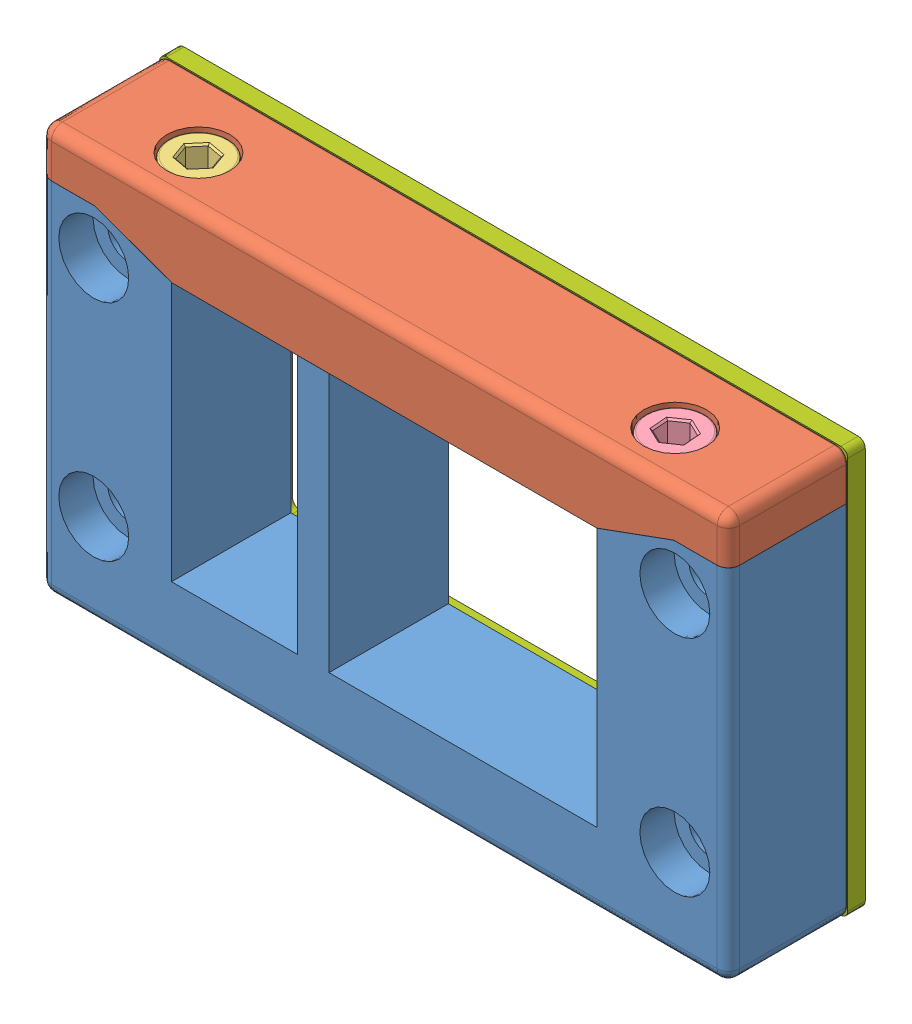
SolidWorks assembly 48212.SLDASM, configuration Default (file format 8000). Lengths in mm.
Overall size (98.3 58 19.55).
7 component instances, 7 part files, 0 mates.
Components (placement in the parent):
- 48212_01-1: 48212_01.SLDPRT [Default] at origin size (98.3 51.5 17.05)
- 48212_02-1: 48212_02.SLDPRT [Default] at origin size (98.3 10.49 17.05)
- 48212_03-1: 48212_03.SLDPRT [Default] at origin size (8.5 57 8.5)
- 48212_04-1: 48212_04.SLDPRT [Default] at origin size (8.5 57 8.5)
- 48212_05-1: 48212_05.SLDPRT [Default] at origin size (9.25 4.7 8.01)
- 48212_06-1: 48212_06.SLDPRT [Default] at origin size (9.25 4.7 8.01)
- 48212_07-1: 48212_07.SLDPRT [Default] at origin size (98.3 58 2.5)
